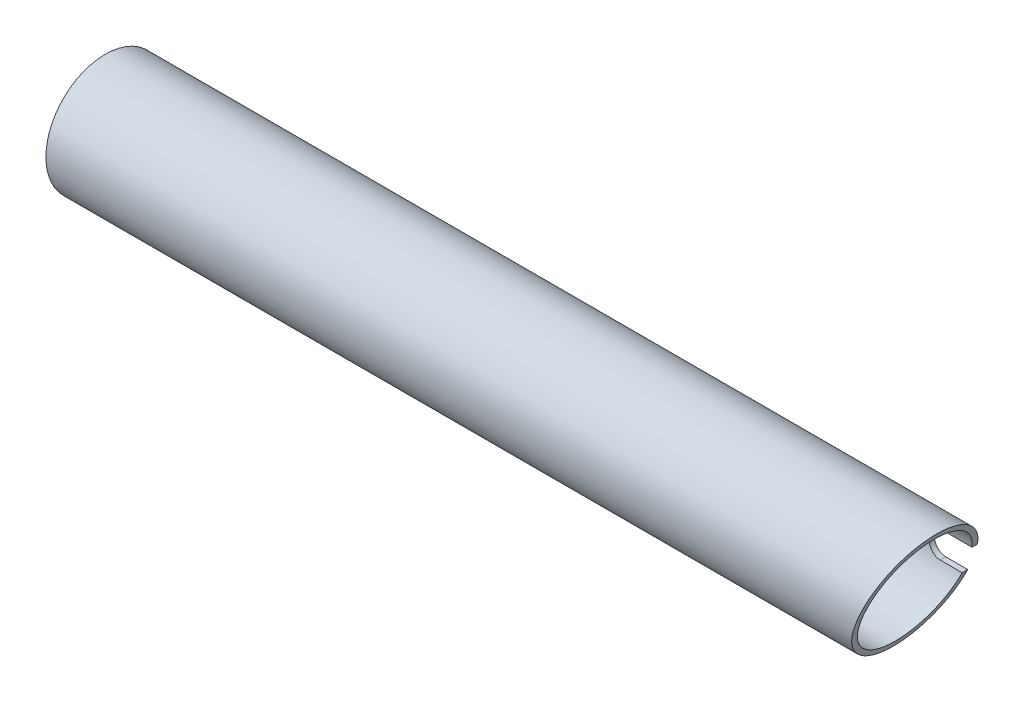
from build123d import *

# Parameters (mm, degrees)
ESQUISSE1_R                  = 11
ESQUISSE1_R_2                = 10
EXTRU_MINCE1_DEPTH           = 160
ENL_V_MAT_EXTRU_1_DEPTH      = 161.754471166
ENL_V_MAT_EXTRU_1_DEPTH_BACK = 161.754471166
ENL_V_MAT_EXTRU_2_DEPTH      = 155.787374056


with BuildPart() as part:
    # Esquisse1 → Extru.-Mince1 (new body)
    with BuildSketch(Plane(origin=(0, 0, 0), x_dir=(0, 0, -1), z_dir=(1, 0, 0))):
        Circle(ESQUISSE1_R)
        Circle(ESQUISSE1_R_2, mode=Mode.SUBTRACT)
    extrude(amount=EXTRU_MINCE1_DEPTH)

    # Esquisse2 → Enl_v. mat.-Extru.1 (cut, two sides: drawn at the far end of the back side and taken through both)
    with BuildSketch(Plane.XY.offset(-ENL_V_MAT_EXTRU_1_DEPTH_BACK)):
        Polygon((263.838056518, 312.767489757), (154.003672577, 11), (145.996327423, -11), (36.161943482, -312.767489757), (639.696922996, -532.436257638), (867.373036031, 93.098721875), align=None)
    extrude(amount=ENL_V_MAT_EXTRU_1_DEPTH + ENL_V_MAT_EXTRU_1_DEPTH_BACK, mode=Mode.SUBTRACT)

    # Esquisse3 → Enl_v. mat.-Extru.2 (cut, through all)
    with BuildSketch(Plane.XY):
        with BuildLine():
            Line((150.909925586, 2.5), (145, 2.5))
            ThreePointArc((145, 2.5), (142.5, 0), (145, -2.5))
            Line((145, -2.5), (149.090074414, -2.5))
            Line((149.090074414, -2.5), (150.909925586, 2.5))
        make_face()
    extrude(amount=-ENL_V_MAT_EXTRU_2_DEPTH, mode=Mode.SUBTRACT)


solid = part.part
